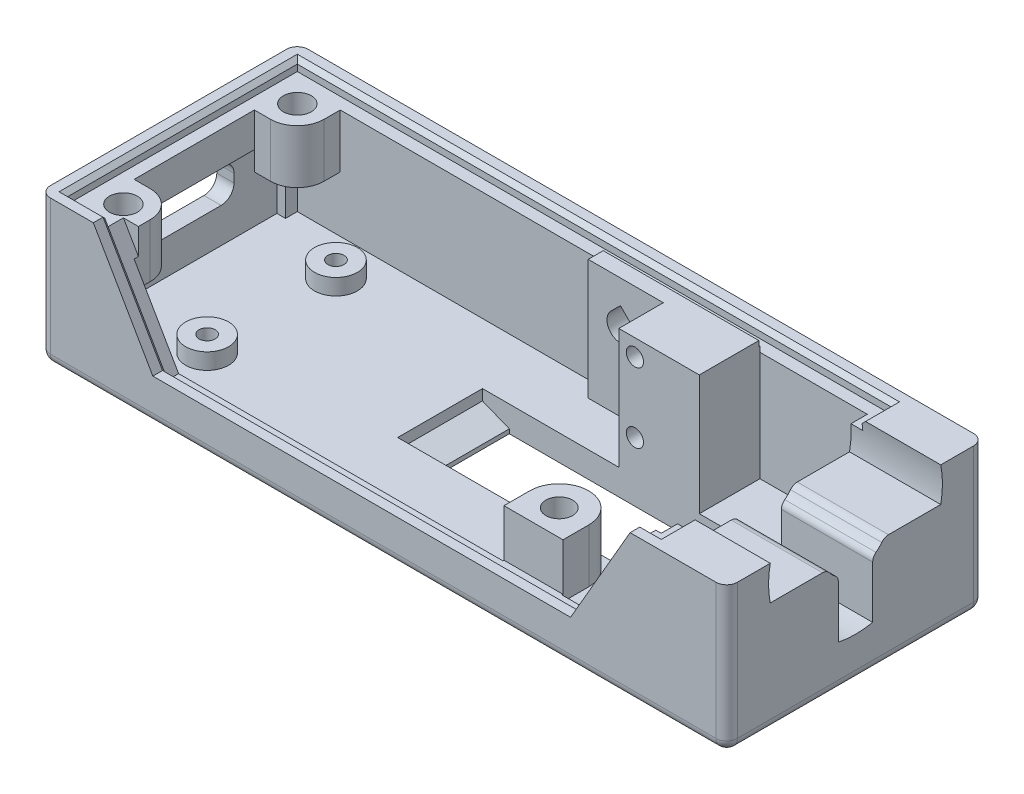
from build123d import *

# Parameters (mm, degrees)
SKIZZE1_W                        = 64
SKIZZE1_H                        = 24
AUFSATZ_LINEAR_AUSTRAGEN1_DEPTH  = 2.4
SKIZZE2_W                        = 64
SKIZZE2_H                        = 24
SKIZZE2_W_2                      = 53.1
SKIZZE2_H_2                      = 19.2
AUFSATZ_LINEAR_AUSTRAGEN2_DEPTH  = 11.2
KOPF_LOCH_DEPTH                  = 8.5
SKIZZE5_W                        = 7.5
SKIZZE5_H                        = 5.65
AUFSATZ_LINEAR_AUSTRAGEN3_DEPTH  = 11.2
SKIZZE7_R                        = 0.8
SCHNITT_LINEAR_AUSTRAGEN2_DEPTH  = 5
SCHNITT_LINEAR_AUSTRAGEN4_DEPTH  = 2.4
SCHNITT_LINEAR_AUSTRAGEN15_DEPTH = 1
SCHNITT_LINEAR_AUSTRAGEN16_DEPTH = 1.1
SKIZZE20_W                       = 7
SKIZZE20_H                       = 11.2
AUFSATZ_LINEAR_AUSTRAGEN4_DEPTH  = 1.5
SCHNITT_LINEAR_AUSTRAGEN17_DEPTH = 2.5
SKIZZE28_W                       = 17
SKIZZE28_H                       = 7
SCHNITT_LINEAR_AUSTRAGEN22_DEPTH = 0.8
SCHNITT_LINEAR_AUSTRAGEN23_DEPTH = 1.6
SKIZZE39_R                       = 2
SKIZZE39_R_2                     = 0.75
MOUNTING_DEPTH                   = 1.5
SKIZZE33_R                       = 1.3
AUFSATZ_LINEAR_AUSTRAGEN7_DEPTH  = 5
SCHNITT_LINEAR_AUSTRAGEN25_DEPTH = 0.4
LEGO_MOUNTINGHOLE_DEPTH          = 3.95
LEGO_MOUNTINGHOLE_DEPTH_BACK     = 3.95
SKIZZE36_R                       = 1.25
AUFSATZ_LINEAR_AUSTRAGEN8_DEPTH  = 5
SKIZZE37_W                       = 5.5
SKIZZE37_H                       = 4.4
SCHNITT_LINEAR_AUSTRAGEN27_DEPTH = 0.1
SKIZZE38_W                       = 14.5
SKIZZE38_H                       = 0.5
SCHNITT_LINEAR_AUSTRAGEN28_DEPTH = 0.1
FASE1_SIZE                       = 0.4
VERRUNDUNG1_R                    = 1


with BuildPart() as part:
    # Skizze1 → Aufsatz-Linear austragen1 (new body)
    with BuildSketch(Plane(origin=(0, 0, 0), x_dir=(1, 0, 0), z_dir=(0, 1, 0))):
        with Locations((-32, 0)):
            Rectangle(SKIZZE1_W, SKIZZE1_H)
    extrude(amount=AUFSATZ_LINEAR_AUSTRAGEN1_DEPTH)

    # Skizze2 → Aufsatz-Linear austragen2 (add)
    with BuildSketch(Plane(origin=(0, 2.4, 0), x_dir=(1, 0, 0), z_dir=(0, 1, 0))):
        with Locations((-32, 0)):
            Rectangle(SKIZZE2_W, SKIZZE2_H)
        with Locations((-35.05, 0)):
            Rectangle(SKIZZE2_W_2, SKIZZE2_H_2, mode=Mode.SUBTRACT)
    extrude(amount=AUFSATZ_LINEAR_AUSTRAGEN2_DEPTH)

    # Skizze3 → Kopf_Loch (cut)
    with BuildSketch(Plane(origin=(0, 0, 0), x_dir=(0, 0, -1), z_dir=(1, 0, 0))):
        with BuildLine():
            Line((-7.940403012, 13.6), (7.940403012, 13.6))
            ThreePointArc((7.940403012, 13.6), (8.1, 12), (7.940403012, 10.4))
            Line((7.940403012, 10.4), (3.07408523, 10.4))
            ThreePointArc((3.07408523, 10.4), (2.723262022, 10.318973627), (2.443503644, 10.092307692))
            ThreePointArc((2.443503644, 10.092307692), (2.192031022, 9.807968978), (1.907692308, 9.556496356))
            ThreePointArc((1.907692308, 9.556496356), (1.681026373, 9.276737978), (1.6, 8.92591477))
            Line((1.6, 8.92591477), (1.6, 4.059596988))
            ThreePointArc((1.6, 4.059596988), (0, 3.9), (-1.6, 4.059596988))
            Line((-1.6, 4.059596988), (-1.6, 8.92591477))
            ThreePointArc((-1.6, 8.92591477), (-1.681026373, 9.276737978), (-1.907692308, 9.556496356))
            ThreePointArc((-1.907692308, 9.556496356), (-2.192031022, 9.807968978), (-2.443503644, 10.092307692))
            ThreePointArc((-2.443503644, 10.092307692), (-2.723262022, 10.318973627), (-3.07408523, 10.4))
            Line((-3.07408523, 10.4), (-7.940403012, 10.4))
            ThreePointArc((-7.940403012, 10.4), (-8.1, 12), (-7.940403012, 13.6))
        make_face()
    extrude(amount=-KOPF_LOCH_DEPTH, mode=Mode.SUBTRACT)

    # Skizze5 → Aufsatz-Linear austragen3 (add)
    with BuildSketch(Plane(origin=(0, 2.4, 0), x_dir=(1, 0, 0), z_dir=(0, 1, 0))):
        with Locations((-22.25, 6.775)):
            Rectangle(SKIZZE5_W, SKIZZE5_H)
    extrude(amount=AUFSATZ_LINEAR_AUSTRAGEN3_DEPTH)

    # Skizze7 → Schnitt-Linear austragen2 (cut)
    with BuildSketch(Plane.XY.offset(-3.95)):
        with Locations((-24.5, 12.05)):
            Circle(SKIZZE7_R)
        with Locations((-24.5, 5.55)):
            Circle(SKIZZE7_R)
    extrude(amount=-SCHNITT_LINEAR_AUSTRAGEN2_DEPTH, mode=Mode.SUBTRACT)

    # Skizze9 → Schnitt-Linear austragen4 (cut)
    with BuildSketch(Plane.XY.offset(12)):
        Polygon((-59, 13.6), (-53.457437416, 4), (-14.542562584, 4), (-9, 13.6), align=None)
    extrude(amount=-SCHNITT_LINEAR_AUSTRAGEN4_DEPTH, mode=Mode.SUBTRACT)

    # Skizze10 → Schnitt-Linear austragen15 (cut)
    with BuildSketch(Plane(origin=(0, 13.6, 0), x_dir=(1, 0, 0), z_dir=(0, 1, 0))):
        Polygon((-8.5, 7.940403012), (-8.5, 9.6), (-61.6, 9.6), (-61.6, -9.6), (-8.5, -9.6), (-8.5, -7.940403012), (-7.4, -7.940403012), (-7.4, -10.7), (-62.7, -10.7), (-62.7, 10.7), (-7.4, 10.7), (-7.4, 7.940403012), align=None)
    extrude(amount=-SCHNITT_LINEAR_AUSTRAGEN15_DEPTH, mode=Mode.SUBTRACT)

    # Skizze19 → Schnitt-Linear austragen16 (cut)
    with BuildSketch(Plane(origin=(0, 0, 9.6), x_dir=(-1, 0, 0), z_dir=(0, 0, -1))):
        Polygon((9.577350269, 12.6), (14.542562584, 4), (53.457437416, 4), (58.422649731, 12.6), (59, 12.6), (58.422649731, 11.6), (53.457437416, 3), (14.542562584, 3), (9, 12.6), align=None)
    extrude(amount=-SCHNITT_LINEAR_AUSTRAGEN16_DEPTH, mode=Mode.SUBTRACT)

    # Skizze20 → Aufsatz-Linear austragen4 (add)
    with BuildSketch(Plane.XY.offset(-9.6)):
        with Locations((-29.5, 8)):
            Rectangle(SKIZZE20_W, SKIZZE20_H)
    extrude(amount=AUFSATZ_LINEAR_AUSTRAGEN4_DEPTH)

    # Skizze22 → Schnitt-Linear austragen17 (cut)
    with BuildSketch(Plane.XY.offset(-8.1)):
        with BuildLine():
            Line((-30, 11.362550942), (-30.881259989, 10.4864992))
            ThreePointArc((-30.881259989, 10.4864992), (-29.935749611, 8.351652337), (-29.214408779, 10.572289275))
            Line((-29.214408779, 10.572289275), (-30, 11.362550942))
        make_face()
    extrude(amount=-SCHNITT_LINEAR_AUSTRAGEN17_DEPTH, mode=Mode.SUBTRACT)

    # Skizze28 → Schnitt-Linear austragen22 (cut)
    with BuildSketch(Plane(origin=(-61.6, 0, 0), x_dir=(0, 0, -1), z_dir=(1, 0, 0))):
        with Locations((0, 5.9)):
            Rectangle(SKIZZE28_W, SKIZZE28_H)
    extrude(amount=-SCHNITT_LINEAR_AUSTRAGEN22_DEPTH, mode=Mode.SUBTRACT)

    # Skizze29 → Schnitt-Linear austragen23 (cut)
    with BuildSketch(Plane.ZY.offset(64)):
        with BuildLine():
            Line((3.3, 8.85), (-3.3, 8.85))
            ThreePointArc((-3.3, 8.85), (-4.148528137, 8.498528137), (-4.5, 7.65))
            Line((-4.5, 7.65), (-4.5, 6.85))
            ThreePointArc((-4.5, 6.85), (-4.148528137, 6.001471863), (-3.3, 5.65))
            Line((-3.3, 5.65), (3.3, 5.65))
            ThreePointArc((3.3, 5.65), (4.148528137, 6.001471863), (4.5, 6.85))
            Line((4.5, 6.85), (4.5, 7.65))
            ThreePointArc((4.5, 7.65), (4.148528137, 8.498528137), (3.3, 8.85))
        make_face()
    extrude(amount=-SCHNITT_LINEAR_AUSTRAGEN23_DEPTH, mode=Mode.SUBTRACT)

    # Skizze39 → Mounting (add)
    # profile 1 of 2: a face of its own
    with BuildSketch(Plane(origin=(0, 2.4, 0), x_dir=(1, 0, 0), z_dir=(0, 1, 0))):
        with Locations(Location((-54.4, 6, 0), (0, 0, 270))):
            Circle(SKIZZE39_R)
        with Locations(Location((-54.4, 6, 0), (0, 0, 270))):
            Circle(SKIZZE39_R_2, mode=Mode.SUBTRACT)
    # profile 2 of 2: a face of its own
    with BuildSketch(Plane(origin=(0, 2.4, 0), x_dir=(1, 0, 0), z_dir=(0, 1, 0))):
        with Locations(Location((-54.4, -6, 0), (0, 0, 90))):
            Circle(SKIZZE39_R)
        with Locations(Location((-54.4, -6, 0), (0, 0, 90))):
            Circle(SKIZZE39_R_2, mode=Mode.SUBTRACT)
    extrude(amount=MOUNTING_DEPTH)

    # Skizze33 → Aufsatz-Linear austragen7 (add)
    # profile 1 of 2: a face of its own
    with BuildSketch(Plane(origin=(0, 12.6, 0), x_dir=(1, 0, 0), z_dir=(0, 1, 0))):
        with BuildLine():
            Line((-57.6, 8.1), (-57.6, 9.6))
            Line((-57.6, 9.6), (-61.6, 9.6))
            Line((-61.6, 9.6), (-61.6, 5.6))
            Line((-61.6, 5.6), (-60.1, 5.6))
            ThreePointArc((-60.1, 5.6), (-58.332233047, 6.332233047), (-57.6, 8.1))
        make_face()
        with Locations(Location((-60.1, 8.1, 0), (0, 0, 270))):
            Circle(SKIZZE33_R, mode=Mode.SUBTRACT)
    # profile 2 of 2: a face of its own
    with BuildSketch(Plane(origin=(0, 12.6, 0), x_dir=(1, 0, 0), z_dir=(0, 1, 0))):
        with BuildLine():
            Line((-61.6, -9.6), (-57.6, -9.6))
            Line((-57.6, -9.6), (-57.6, -8.1))
            ThreePointArc((-57.6, -8.1), (-58.332233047, -6.332233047), (-60.1, -5.6))
            Line((-60.1, -5.6), (-61.6, -5.6))
            Line((-61.6, -5.6), (-61.6, -9.6))
        make_face()
        with Locations(Location((-60.1, -8.1, 0), (0, 0, 90))):
            Circle(SKIZZE33_R, mode=Mode.SUBTRACT)
    extrude(amount=-AUFSATZ_LINEAR_AUSTRAGEN7_DEPTH)

    # Skizze34 → Schnitt-Linear austragen25 (cut)
    with BuildSketch(Plane.XY.offset(9.6)):
        Polygon((-59, 12.6), (-57.6, 10.175128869), (-57.6, 12.6), align=None)
    extrude(amount=-SCHNITT_LINEAR_AUSTRAGEN25_DEPTH, mode=Mode.SUBTRACT)

    # Skizze35 → Lego_MountingHole (cut, two sides: drawn at the far end of the back side and taken through both)
    with BuildSketch(Plane.XY.offset(-LEGO_MOUNTINGHOLE_DEPTH_BACK)):
        Polygon((-38.7, 1.4), (-36.2, 0.4), (-36.2, 0), (-12, 0), (-12, 0.4), (-9.5, 1.4), (-9.5, 2.4), (-38.7, 2.4), align=None)
    extrude(amount=LEGO_MOUNTINGHOLE_DEPTH + LEGO_MOUNTINGHOLE_DEPTH_BACK, mode=Mode.SUBTRACT)

    # Skizze36 → Aufsatz-Linear austragen8 (add)
    with BuildSketch(Plane(origin=(0, 2.4, 0), x_dir=(1, 0, 0), z_dir=(0, 1, 0))):
        with BuildLine():
            Line((-23.25, -7.1), (-23.25, -9.6))
            Line((-23.25, -9.6), (-17.75, -9.6))
            Line((-17.75, -9.6), (-17.75, -7.1))
            ThreePointArc((-17.75, -7.1), (-20.5, -4.35), (-23.25, -7.1))
        make_face()
        with Locations(Location((-20.5, -7.1, 0), (0, 0, 270))):
            Circle(SKIZZE36_R, mode=Mode.SUBTRACT)
    extrude(amount=AUFSATZ_LINEAR_AUSTRAGEN8_DEPTH)

    # Skizze37 → Schnitt-Linear austragen27 (cut)
    with BuildSketch(Plane.XY.offset(9.6)):
        with Locations((-20.5, 5.2)):
            Rectangle(SKIZZE37_W, SKIZZE37_H)
    extrude(amount=-SCHNITT_LINEAR_AUSTRAGEN27_DEPTH, mode=Mode.SUBTRACT)

    # Skizze38 → Schnitt-Linear austragen28 (cut)
    with BuildSketch(Plane(origin=(0, 0, -9.6), x_dir=(-1, 0, 0), z_dir=(0, 0, -1))):
        with Locations((25.75, 13.35)):
            Rectangle(SKIZZE38_W, SKIZZE38_H)
    extrude(amount=-SCHNITT_LINEAR_AUSTRAGEN28_DEPTH, mode=Mode.SUBTRACT)

    # Fase1
    fase1_edges = [part.edges().sort_by_distance(p)[0] for p in [
        (-11.771281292, 8.8, 10.7),
        (-56.228718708, 8.8, 10.7),
        (-7.4, 13.6, -9.320201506),
        (-35.05, 13.6, -10.7),
        (-62.7, 13.6, 0),
        (-60.85, 13.6, 10.7),
        (-8.2, 13.6, 10.7),
        (-7.4, 13.6, 9.320201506),
        (-34, 4, 10.7),
    ]]
    chamfer(fase1_edges, length=FASE1_SIZE)

    # Verrundung1
    verrundung1_edges = [part.edges().sort_by_distance(p)[0] for p in [
        (-32, 0, -12),
        (0, 0, 0),
        (-32, 0, 12),
        (-64, 0, 0),
        (-64, 6.8, -12),
        (0, 6.8, -12),
        (0, 6.8, 12),
        (-64, 6.8, 12),
    ]]
    fillet(verrundung1_edges, radius=VERRUNDUNG1_R)


solid = part.part
